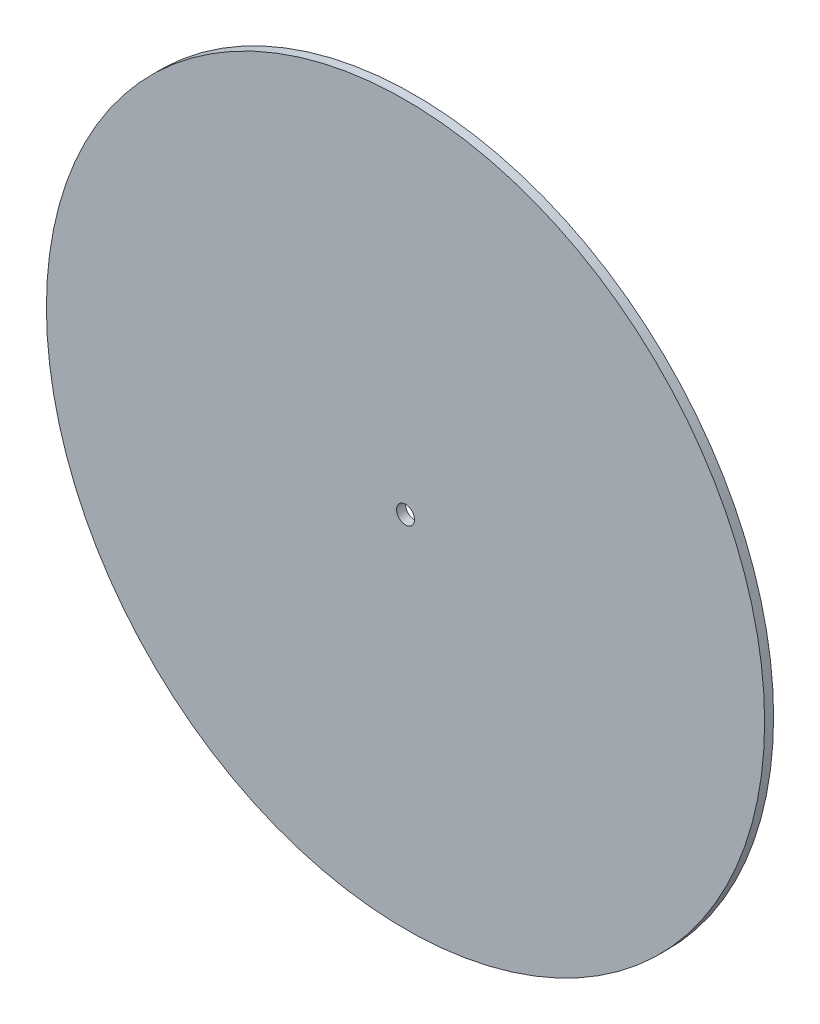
from build123d import *

# Parameters (mm, degrees)
SKETCH1_R           = 40
SKETCH1_R_2         = 1
BOSS_EXTRUDE1_DEPTH = 1


with BuildPart() as part:
    # Sketch1 → Boss-Extrude1 (new body)
    with BuildSketch(Plane.XY):
        Circle(SKETCH1_R)
        Circle(SKETCH1_R_2, mode=Mode.SUBTRACT)
    extrude(amount=BOSS_EXTRUDE1_DEPTH)


solid = part.part
